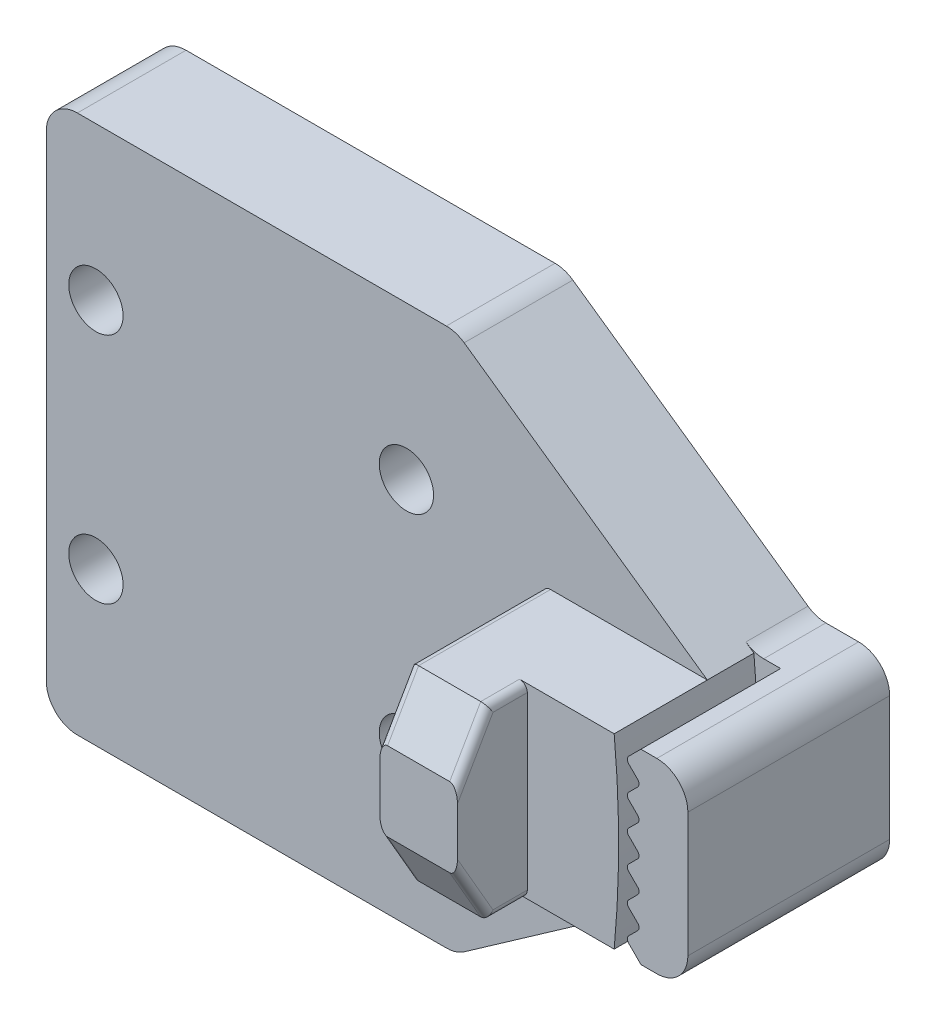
from build123d import *
from OCP.BRepFilletAPI import BRepFilletAPI_MakeChamfer

# Parameters (mm, degrees)
EXTRUDE_1_DEPTH      = 4
EXTRUDE_1_DEPTH_BACK = 3
SKETCH_1_W           = 26.4
SKETCH_1_H           = 34.7
SKETCH_1_R           = 1.75
EXTRUDE_START        = 4
EXTRUDE_2_DEPTH      = 6
EXTRUDE_3_DEPTH      = 1
EXTRUDE_3_DEPTH_BACK = 3
FILLET_1_R           = 2
SKETCH_2_W           = 5
SKETCH_2_H           = 12.015250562
EXTRUDE_4_DEPTH      = 10.5
CHAMFER_2_SIZE       = 2
CHAMFER_2_SIZE2      = 3.464101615
FILLET_2_R           = 0.5


with BuildPart() as part:
    # Sketch 1 → Extrude 1 (new, two sides: drawn at the far end of the back side and taken through both)
    # profile 1 of 4: a face of its own
    with BuildSketch(Plane.XY.offset(-EXTRUDE_1_DEPTH_BACK)):
        Polygon((13.064807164, 17.461834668), (13.064807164, -17.238165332), (29.24315013, -5.895849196), (21.86916953, -5.895849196), (21.86916953, 6.119401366), (29.24315013, 6.119401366), align=None)
    # profile 2 of 4: a face of its own
    with BuildSketch(Plane.XY.offset(-EXTRUDE_1_DEPTH_BACK)):
        with Locations((-0.135192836, 0.111834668)):
            Rectangle(SKETCH_1_W, SKETCH_1_H)
        with Locations((9.85875861, -7.388165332)):
            Circle(SKETCH_1_R, mode=Mode.SUBTRACT)
        with Locations((-10.14124139, -7.388165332)):
            Circle(SKETCH_1_R, mode=Mode.SUBTRACT)
        with Locations((9.85875861, 7.611834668)):
            Circle(SKETCH_1_R, mode=Mode.SUBTRACT)
        with Locations((-10.14124139, 7.611834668)):
            Circle(SKETCH_1_R, mode=Mode.SUBTRACT)
    # profile 3 of 4: a face of its own
    with BuildSketch(Plane.XY.offset(-EXTRUDE_1_DEPTH_BACK)):
        with BuildLine():
            Line((21.86916953, -5.895849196), (29.24315013, -5.895849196))
            ThreePointArc((29.24315013, -5.895849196), (29.53124223, 0.111776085), (29.24315013, 6.119401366))
            Line((29.24315013, 6.119401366), (21.86916953, 6.119401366))
            Line((21.86916953, 6.119401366), (21.86916953, -5.895849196))
        make_face()
    # profile 4 of 4: a face of its own
    with BuildSketch(Plane.XY.offset(-EXTRUDE_1_DEPTH_BACK)):
        with BuildLine():
            Line((30.969143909, -5.894657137), (30.967951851, -5.895849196))
            Line((30.967951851, -5.895849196), (33.989360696, -5.895849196))
            Line((33.989360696, -5.895849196), (33.989360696, 6.119401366))
            Line((33.989360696, 6.119401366), (30.963902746, 6.119401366))
            Line((30.963902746, 6.119401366), (30.178059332, 5.333557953))
            ThreePointArc((30.178059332, 5.333557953), (30.090191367, 5.121425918), (30.178059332, 4.909293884))
            Line((30.178059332, 4.909293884), (30.757011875, 4.330341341))
            ThreePointArc((30.757011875, 4.330341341), (30.84487984, 4.118209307), (30.757011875, 3.906077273))
            Line((30.757011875, 3.906077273), (30.181275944, 3.330341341))
            ThreePointArc((30.181275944, 3.330341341), (30.093407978, 3.118209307), (30.181275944, 2.906077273))
            Line((30.181275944, 2.906077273), (30.757011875, 2.330341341))
            ThreePointArc((30.757011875, 2.330341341), (30.84487984, 2.118209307), (30.757011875, 1.906077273))
            Line((30.757011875, 1.906077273), (30.178059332, 1.32712473))
            ThreePointArc((30.178059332, 1.32712473), (30.090191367, 1.114992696), (30.178059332, 0.902860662))
            Line((30.178059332, 0.902860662), (30.757011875, 0.323908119))
            ThreePointArc((30.757011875, 0.323908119), (30.84487984, 0.111776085), (30.757011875, -0.10035595))
            Line((30.757011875, -0.10035595), (30.181275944, -0.676091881))
            ThreePointArc((30.181275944, -0.676091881), (30.093407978, -0.888223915), (30.181275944, -1.10035595))
            Line((30.181275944, -1.10035595), (30.757011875, -1.676091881))
            ThreePointArc((30.757011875, -1.676091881), (30.84487984, -1.888223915), (30.757011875, -2.10035595))
            Line((30.757011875, -2.10035595), (30.178059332, -2.679308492))
            ThreePointArc((30.178059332, -2.679308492), (30.090191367, -2.891440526), (30.178059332, -3.103572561))
            Line((30.178059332, -3.103572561), (30.757011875, -3.682525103))
            ThreePointArc((30.757011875, -3.682525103), (30.84487984, -3.894657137), (30.757011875, -4.106789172))
            Line((30.757011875, -4.106789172), (30.181275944, -4.682525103))
            ThreePointArc((30.181275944, -4.682525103), (30.093407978, -4.894657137), (30.181275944, -5.106789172))
            Line((30.181275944, -5.106789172), (30.969143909, -5.894657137))
        make_face()
    extrude(amount=EXTRUDE_1_DEPTH + EXTRUDE_1_DEPTH_BACK)

    # Sketch 1_3 → Extrude 2 (add)
    with BuildSketch(Plane.XY.offset(EXTRUDE_START)):
        with BuildLine():
            Line((21.86916953, -5.895849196), (29.24315013, -5.895849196))
            ThreePointArc((29.24315013, -5.895849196), (29.53124223, 0.111776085), (29.24315013, 6.119401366))
            Line((29.24315013, 6.119401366), (21.86916953, 6.119401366))
            Line((21.86916953, 6.119401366), (21.86916953, -5.895849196))
        make_face()
        with BuildLine():
            Line((30.969143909, -5.894657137), (30.967951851, -5.895849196))
            Line((30.967951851, -5.895849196), (33.989360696, -5.895849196))
            Line((33.989360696, -5.895849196), (33.989360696, 6.119401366))
            Line((33.989360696, 6.119401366), (30.963902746, 6.119401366))
            Line((30.963902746, 6.119401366), (30.178059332, 5.333557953))
            ThreePointArc((30.178059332, 5.333557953), (30.090191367, 5.121425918), (30.178059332, 4.909293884))
            Line((30.178059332, 4.909293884), (30.757011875, 4.330341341))
            ThreePointArc((30.757011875, 4.330341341), (30.84487984, 4.118209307), (30.757011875, 3.906077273))
            Line((30.757011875, 3.906077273), (30.181275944, 3.330341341))
            ThreePointArc((30.181275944, 3.330341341), (30.093407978, 3.118209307), (30.181275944, 2.906077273))
            Line((30.181275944, 2.906077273), (30.757011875, 2.330341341))
            ThreePointArc((30.757011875, 2.330341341), (30.84487984, 2.118209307), (30.757011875, 1.906077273))
            Line((30.757011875, 1.906077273), (30.178059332, 1.32712473))
            ThreePointArc((30.178059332, 1.32712473), (30.090191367, 1.114992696), (30.178059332, 0.902860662))
            Line((30.178059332, 0.902860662), (30.757011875, 0.323908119))
            ThreePointArc((30.757011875, 0.323908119), (30.84487984, 0.111776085), (30.757011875, -0.10035595))
            Line((30.757011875, -0.10035595), (30.181275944, -0.676091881))
            ThreePointArc((30.181275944, -0.676091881), (30.093407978, -0.888223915), (30.181275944, -1.10035595))
            Line((30.181275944, -1.10035595), (30.757011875, -1.676091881))
            ThreePointArc((30.757011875, -1.676091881), (30.84487984, -1.888223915), (30.757011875, -2.10035595))
            Line((30.757011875, -2.10035595), (30.178059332, -2.679308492))
            ThreePointArc((30.178059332, -2.679308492), (30.090191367, -2.891440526), (30.178059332, -3.103572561))
            Line((30.178059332, -3.103572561), (30.757011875, -3.682525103))
            ThreePointArc((30.757011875, -3.682525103), (30.84487984, -3.894657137), (30.757011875, -4.106789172))
            Line((30.757011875, -4.106789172), (30.181275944, -4.682525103))
            ThreePointArc((30.181275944, -4.682525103), (30.093407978, -4.894657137), (30.181275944, -5.106789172))
            Line((30.181275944, -5.106789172), (30.969143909, -5.894657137))
        make_face()
    extrude(amount=EXTRUDE_2_DEPTH)

    # Sketch 1_4 → Extrude 3 (add, two sides: drawn at the far end of the back side and taken through both)
    with BuildSketch(Plane.XY.offset(-EXTRUDE_3_DEPTH_BACK)):
        with BuildLine():
            ThreePointArc((29.24315013, 6.119401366), (29.53124223, 0.111776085), (29.24315013, -5.895849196))
            Line((29.24315013, -5.895849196), (30.967951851, -5.895849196))
            Line((30.967951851, -5.895849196), (30.969143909, -5.894657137))
            Line((30.969143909, -5.894657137), (30.181275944, -5.106789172))
            ThreePointArc((30.181275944, -5.106789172), (30.093407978, -4.894657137), (30.181275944, -4.682525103))
            Line((30.181275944, -4.682525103), (30.757011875, -4.106789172))
            ThreePointArc((30.757011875, -4.106789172), (30.84487984, -3.894657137), (30.757011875, -3.682525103))
            Line((30.757011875, -3.682525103), (30.178059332, -3.103572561))
            ThreePointArc((30.178059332, -3.103572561), (30.090191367, -2.891440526), (30.178059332, -2.679308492))
            Line((30.178059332, -2.679308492), (30.757011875, -2.10035595))
            ThreePointArc((30.757011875, -2.10035595), (30.84487984, -1.888223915), (30.757011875, -1.676091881))
            Line((30.757011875, -1.676091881), (30.181275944, -1.10035595))
            ThreePointArc((30.181275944, -1.10035595), (30.093407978, -0.888223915), (30.181275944, -0.676091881))
            Line((30.181275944, -0.676091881), (30.757011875, -0.10035595))
            ThreePointArc((30.757011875, -0.10035595), (30.84487984, 0.111776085), (30.757011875, 0.323908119))
            Line((30.757011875, 0.323908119), (30.178059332, 0.902860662))
            ThreePointArc((30.178059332, 0.902860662), (30.090191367, 1.114992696), (30.178059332, 1.32712473))
            Line((30.178059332, 1.32712473), (30.757011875, 1.906077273))
            ThreePointArc((30.757011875, 1.906077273), (30.84487984, 2.118209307), (30.757011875, 2.330341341))
            Line((30.757011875, 2.330341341), (30.181275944, 2.906077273))
            ThreePointArc((30.181275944, 2.906077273), (30.093407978, 3.118209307), (30.181275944, 3.330341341))
            Line((30.181275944, 3.330341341), (30.757011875, 3.906077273))
            ThreePointArc((30.757011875, 3.906077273), (30.84487984, 4.118209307), (30.757011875, 4.330341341))
            Line((30.757011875, 4.330341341), (30.178059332, 4.909293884))
            ThreePointArc((30.178059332, 4.909293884), (30.090191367, 5.121425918), (30.178059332, 5.333557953))
            Line((30.178059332, 5.333557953), (30.963902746, 6.119401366))
            Line((30.963902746, 6.119401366), (29.24315013, 6.119401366))
        make_face()
    extrude(amount=EXTRUDE_3_DEPTH + EXTRUDE_3_DEPTH_BACK)

    # Fillet 1
    fillet_1_edges = [part.edges().sort_by_distance(p)[0] for p in [
        (33.989360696, 6.119401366, 3.5),
        (33.989360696, -5.895849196, 3.5),
        (13.064807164, -17.238165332, 0.5),
        (-13.335192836, -17.238165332, 0.5),
        (-13.335192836, 17.461834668, 0.5),
        (13.064807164, 17.461834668, 0.5),
        (29.24315013, 6.119401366, -1),
        (29.24315013, -5.895849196, -1),
    ]]
    fillet(fillet_1_edges, radius=FILLET_1_R)

    # Sketch 2 → Extrude 4 (add)
    with BuildSketch(Plane.XY.offset(4)):
        with Locations((21.146996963, 0.111776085)):
            Rectangle(SKETCH_2_W, SKETCH_2_H)
    extrude(amount=EXTRUDE_4_DEPTH)

    # Chamfer 2: one chamfer whose edges measure the first distance from different faces: ONE call of the kernel's chamfer builder (chamfer() names one face for all edges)
    chamfer_2_edges_1 = [part.edges().sort_by_distance(p)[0] for p in [
        (21.146996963, 6.119401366, 14.5),
    ]]
    chamfer_2_side_1 = [part.faces().sort_by_distance(p)[0] for p in [
        (23.213672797, 6.119401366, 8.3723191),
    ]]
    chamfer_2_edges_2 = [part.edges().sort_by_distance(p)[0] for p in [
        (21.146996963, -5.895849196, 14.5),
    ]]
    chamfer_2_side_2 = [part.faces().sort_by_distance(p)[0] for p in [
        (23.213672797, -5.895849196, 8.3723191),
    ]]
    chamfer_2 = BRepFilletAPI_MakeChamfer(part.part.solid().wrapped)
    for e in chamfer_2_edges_1:
        chamfer_2.Add(CHAMFER_2_SIZE, CHAMFER_2_SIZE2, e.wrapped, chamfer_2_side_1[0].wrapped)  # the first distance lies on this face
    for e in chamfer_2_edges_2:
        chamfer_2.Add(CHAMFER_2_SIZE, CHAMFER_2_SIZE2, e.wrapped, chamfer_2_side_2[0].wrapped)  # the first distance lies on this face
    add(Compound.cast(chamfer_2.Shape()), mode=Mode.REPLACE)

    # Fillet 2
    fillet_2_edges = [part.edges().sort_by_distance(p)[0] for p in [
        (23.646996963, 6.119401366, 11.25),
        (23.646996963, -5.895849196, 11.25),
        (23.646996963, 4.387350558, 13.5),
        (23.646996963, -4.163798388, 13.5),
        (18.646996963, -5.895849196, 8.25),
        (18.646996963, 6.119401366, 8.25),
        (18.646996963, 4.387350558, 13.5),
        (18.646996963, -4.163798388, 13.5),
    ]]
    fillet(fillet_2_edges, radius=FILLET_2_R)


solid = part.part
